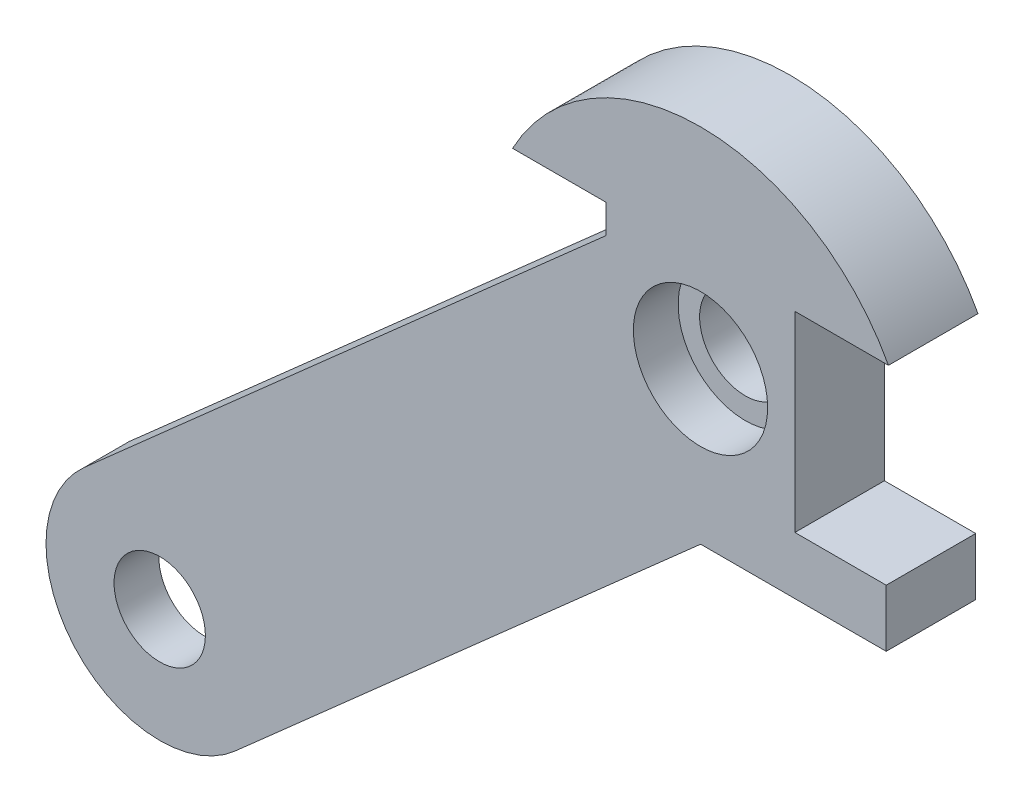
from build123d import *

# Parameters (mm, degrees)
BOSS_EXTRUDE2_DEPTH     = 10
CUT_EXTRUDE2_DEPTH      = 32.853215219
CUT_EXTRUDE2_DEPTH_BACK = 32.853215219
SKETCH4_R               = 5.1
BOSS_EXTRUDE4_DEPTH     = 5
SKETCH9_R               = 5
SKETCH9_R_2             = 5.1
CUT_EXTRUDE5_DEPTH      = 5
SKETCH10_R              = 7.5
CUT_EXTRUDE6_DEPTH      = 5


with BuildPart() as part:
    # Sketch3 → Boss-Extrude2 (new body)
    with BuildSketch(Plane.XY):
        with BuildLine():
            Line((-20.74, -16.94245), (20.74, -16.94245))
            Line((20.74, -16.94245), (20.74, -10.5429))
            Line((20.74, -10.5429), (10.54169, -10.5429))
            Line((10.54169, -10.5429), (10.54169, 10.84581))
            Line((10.54169, 10.84581), (20.99169, 10.84581))
            ThreePointArc((20.99169, 10.84581), (0, 23.430242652), (-20.99169, 10.84581))
            Line((-20.99169, 10.84581), (-10.54169, 10.84581))
            Line((-10.54169, 10.84581), (-10.54169, -10.5429))
            Line((-10.54169, -10.5429), (-20.74, -10.5429))
            Line((-20.74, -10.5429), (-20.74, -16.94245))
        make_face()
    extrude(amount=BOSS_EXTRUDE2_DEPTH)

    # Sketch4 → Cut-Extrude2 (cut, two sides: drawn at the far end of the back side and taken through both)
    with BuildSketch(Plane.XY.offset(5).offset(-CUT_EXTRUDE2_DEPTH_BACK)):
        Circle(SKETCH4_R)
    extrude(amount=CUT_EXTRUDE2_DEPTH + CUT_EXTRUDE2_DEPTH_BACK, mode=Mode.SUBTRACT)

    # Sketch8 → Boss-Extrude4 (add)
    with BuildSketch(Plane.XY.offset(5)):
        with BuildLine():
            Line((-7.805332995, 10.051368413), (-68.814808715, -43.925256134))
            ThreePointArc((-68.814808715, -43.925256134), (-69.911271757, -61.852268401), (-51.984259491, -62.948731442))
            Line((-51.984259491, -62.948731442), (9.02521623, -8.972106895))
            ThreePointArc((9.02521623, -8.972106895), (5.664985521, 5.011955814), (-7.805332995, 10.051368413))
        make_face()
    extrude(amount=BOSS_EXTRUDE4_DEPTH)

    # Sketch9 → Cut-Extrude5 (cut)
    with BuildSketch(Plane.XY.offset(5)):
        Circle(SKETCH9_R)
        with Locations((-60.399534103, -53.436993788)):
            Circle(SKETCH9_R_2)
    extrude(amount=CUT_EXTRUDE5_DEPTH, mode=Mode.SUBTRACT)

    # Sketch10 → Cut-Extrude6 (cut)
    with BuildSketch(Plane.XY.offset(5)):
        Circle(SKETCH10_R)
    extrude(amount=CUT_EXTRUDE6_DEPTH, mode=Mode.SUBTRACT)


solid = part.part
